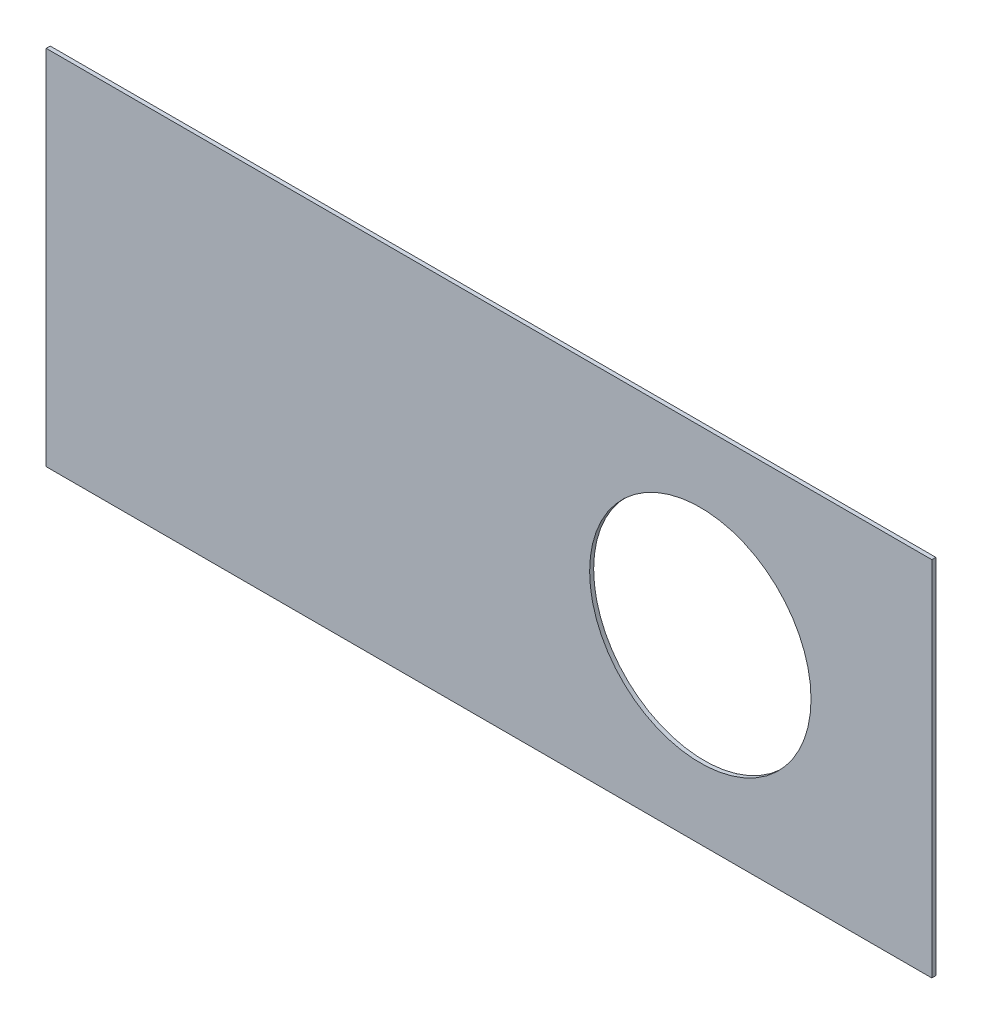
from build123d import *

# Parameters (mm, degrees)
ESQUISSE1_W        = 220
ESQUISSE1_H        = 90
ESQUISSE1_R        = 27.5
BOSS_EXTRU_1_DEPTH = 1


with BuildPart() as part:
    # Esquisse1 → Boss.-Extru.1 (new body)
    with BuildSketch(Plane.XY):
        with Locations((-41.59935419, 2.852112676)):
            Rectangle(ESQUISSE1_W, ESQUISSE1_H)
        with Locations((10.90064581, 2.852112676)):
            Circle(ESQUISSE1_R, mode=Mode.SUBTRACT)
    extrude(amount=BOSS_EXTRU_1_DEPTH)


solid = part.part
